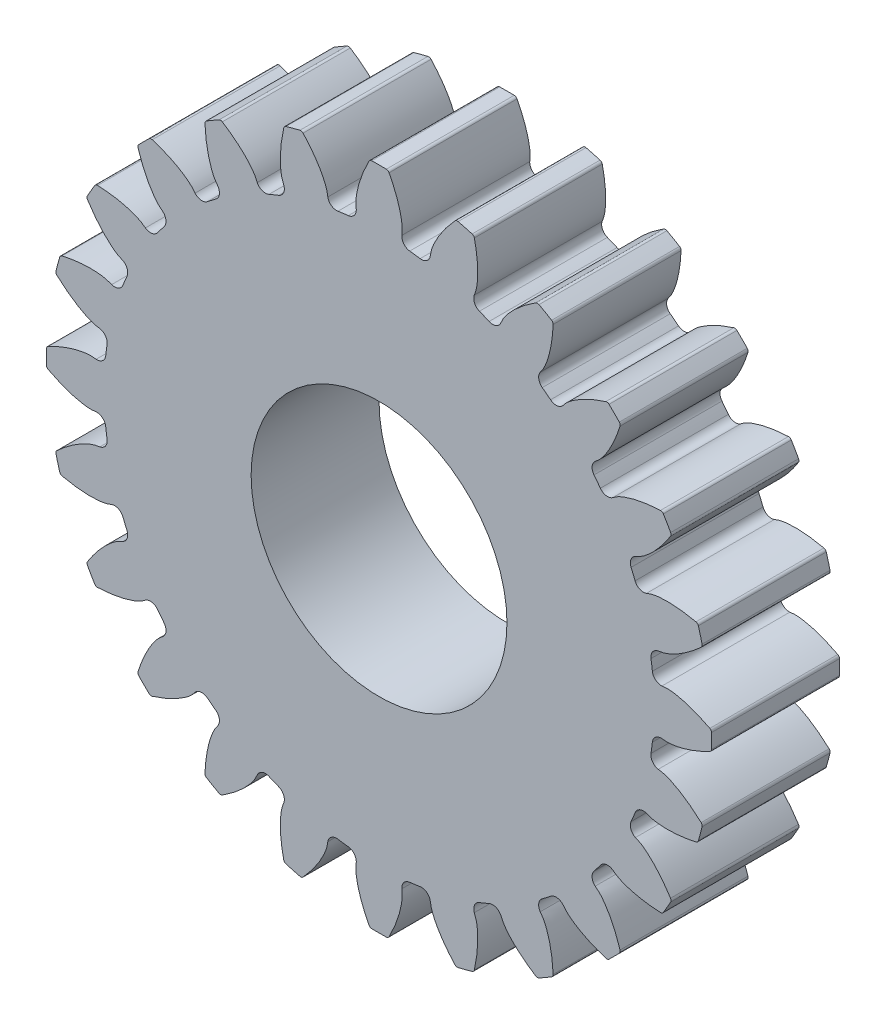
from build123d import *

# Parameters (mm, degrees)
FIRST_TOOTH_DEPTH      = 5
SKETCH3_R              = 10.75
ROOT_CIRCLE_DEPTH      = 5
ROOT_FILLET_R          = 0.35
TIP_RADIUS_R           = 0.125
TEETH_COUNT            = 24
ROOT_FILLET_OF_TEETH_R = 0.35
TIP_RADIUS_OF_TEETH_R  = 0.125
CENTER_HOLE_REACH      = 21.053
SKETCH4_R              = 5


with BuildPart() as part:
    # Sketch2 → First Tooth (new body)
    with BuildSketch(Plane.XY):
        with BuildLine():
            ThreePointArc((0.357729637, 12.995077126), (0, 13), (-0.357729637, 12.995077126))
            add(Edge.make_bspline(
                [(-0.357729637, 12.995077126), (-0.399563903, 12.91726348), (-0.459933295, 12.799256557), (-0.535150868, 12.639358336), (-0.588779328, 12.518162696), (-0.63945699, 12.395702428), (-0.686992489, 12.271986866), (-0.731162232, 12.14702795), (-0.771698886, 12.020840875), (-0.808276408, 11.893446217), (-0.840474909, 11.764869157), (-0.867757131, 11.635154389), (-0.889265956, 11.504332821), (-0.903946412, 11.372593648), (-0.908289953, 11.239772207), (-0.893638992, 11.107877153), (-0.884077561, 10.975733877), (-0.873152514, 10.843657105), (-0.8625924, 10.711562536), (-0.722121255, 8.970344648), (-0.590037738, 7.272920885), (-0.452562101, 5.619963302)],
                knots=[0, 0, 0, 0, 0.035369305, 0.053053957, 0.07073861, 0.088423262, 0.106107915, 0.123792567, 0.14147722, 0.159161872, 0.176846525, 0.194531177, 0.21221583, 0.229900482, 0.247585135, 0.265269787, 0.28295444, 0.300639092, 0.318323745, 0.336008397, 1, 1, 1, 1], degree=3))
            ThreePointArc((-0.452562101, 5.619963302), (0, -5.638155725), (0.452562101, 5.619963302))
            add(Edge.make_bspline(
                [(0.357729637, 12.995077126), (0.399563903, 12.91726348), (0.459933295, 12.799256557), (0.535150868, 12.639358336), (0.588779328, 12.518162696), (0.63945699, 12.395702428), (0.686992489, 12.271986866), (0.731162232, 12.14702795), (0.771698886, 12.020840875), (0.808276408, 11.893446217), (0.840474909, 11.764869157), (0.867757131, 11.635154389), (0.889265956, 11.504332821), (0.903946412, 11.372593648), (0.908289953, 11.239772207), (0.893638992, 11.107877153), (0.884077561, 10.975733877), (0.873152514, 10.843657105), (0.8625924, 10.711562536), (0.722121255, 8.970344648), (0.590037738, 7.272920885), (0.452562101, 5.619963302)],
                knots=[0, 0, 0, 0, 0.035369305, 0.053053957, 0.07073861, 0.088423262, 0.106107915, 0.123792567, 0.14147722, 0.159161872, 0.176846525, 0.194531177, 0.21221583, 0.229900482, 0.247585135, 0.265269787, 0.28295444, 0.300639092, 0.318323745, 0.336008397, 1, 1, 1, 1], degree=3))
        make_face()
    first_tooth = extrude(amount=FIRST_TOOTH_DEPTH)

    # Sketch3 → Root Circle (add)
    with BuildSketch(Plane.XY.offset(5)):
        Circle(SKETCH3_R)
    extrude(amount=-ROOT_CIRCLE_DEPTH)

    # Root Fillet
    root_fillet_edges = [part.edges().sort_by_distance(p)[0] for p in [
        (0.862877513, 10.715313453, 2.5),
        (-0.862877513, 10.715313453, 2.5),
    ]]
    fillet(root_fillet_edges, radius=ROOT_FILLET_R)

    # Tip Radius
    tip_radius_edges = [part.edges().sort_by_distance(p)[0] for p in [
        (-0.357729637, 12.995077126, 2.5),
        (0.357729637, 12.995077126, 2.5),
    ]]
    fillet(tip_radius_edges, radius=TIP_RADIUS_R)

    # Teeth: First Tooth ×24 about axis
    teeth_axis = Axis((0, 0, 5), (0, 0, -1))
    for i in range(1, TEETH_COUNT):
        add(first_tooth.rotate(teeth_axis, i * 360 / TEETH_COUNT))

    # Root Fillet of Teeth
    root_fillet_of_teeth_edges = [part.edges().sort_by_distance(p)[0] for p in [
        (3.60680287, 10.126868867, 2.5),
        (1.939851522, 10.573527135, 2.5),
        (6.104930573, 8.848294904, 2.5),
        (4.61038288, 9.711172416, 2.5),
        (8.187017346, 6.966724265, 2.5),
        (6.966724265, 8.187017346, 2.5),
        (9.711172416, 4.61038288, 2.5),
        (8.848294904, 6.104930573, 2.5),
        (10.573527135, 1.939851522, 2.5),
        (10.126868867, 3.60680287, 2.5),
        (10.715313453, -0.862877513, 2.5),
        (10.715313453, 0.862877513, 2.5),
        (10.126868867, -3.60680287, 2.5),
        (10.573527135, -1.939851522, 2.5),
        (8.848294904, -6.104930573, 2.5),
        (9.711172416, -4.61038288, 2.5),
        (6.966724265, -8.187017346, 2.5),
        (8.187017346, -6.966724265, 2.5),
        (4.61038288, -9.711172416, 2.5),
        (6.104930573, -8.848294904, 2.5),
        (1.939851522, -10.573527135, 2.5),
        (3.60680287, -10.126868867, 2.5),
        (-0.862877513, -10.715313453, 2.5),
        (0.862877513, -10.715313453, 2.5),
        (-3.60680287, -10.126868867, 2.5),
        (-1.939851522, -10.573527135, 2.5),
        (-6.104930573, -8.848294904, 2.5),
        (-4.61038288, -9.711172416, 2.5),
        (-8.187017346, -6.966724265, 2.5),
        (-6.966724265, -8.187017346, 2.5),
        (-9.711172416, -4.61038288, 2.5),
        (-8.848294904, -6.104930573, 2.5),
        (-10.573527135, -1.939851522, 2.5),
        (-10.126868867, -3.60680287, 2.5),
        (-10.715313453, 0.862877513, 2.5),
        (-10.715313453, -0.862877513, 2.5),
        (-10.126868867, 3.60680287, 2.5),
        (-10.573527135, 1.939851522, 2.5),
        (-8.848294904, 6.104930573, 2.5),
        (-9.711172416, 4.61038288, 2.5),
        (-6.966724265, 8.187017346, 2.5),
        (-8.187017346, 6.966724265, 2.5),
        (-4.61038288, 9.711172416, 2.5),
        (-6.104930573, 8.848294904, 2.5),
        (-1.939851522, 10.573527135, 2.5),
        (-3.60680287, 10.126868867, 2.5),
    ]]
    fillet(root_fillet_of_teeth_edges, radius=ROOT_FILLET_OF_TEETH_R)

    # Tip Radius of Teeth
    tip_radius_of_teeth_edges = [part.edges().sort_by_distance(p)[0] for p in [
        (3.017833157, 12.644867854, 2.5),
        (3.708913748, 12.459693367, 2.5),
        (6.187735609, 11.432931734, 2.5),
        (6.807341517, 11.075202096, 2.5),
        (8.935954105, 9.44186021, 2.5),
        (9.44186021, 8.935954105, 2.5),
        (11.075202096, 6.807341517, 2.5),
        (11.432931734, 6.187735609, 2.5),
        (12.459693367, 3.708913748, 2.5),
        (12.644867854, 3.017833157, 2.5),
        (12.995077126, 0.357729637, 2.5),
        (12.995077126, -0.357729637, 2.5),
        (12.644867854, -3.017833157, 2.5),
        (12.459693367, -3.708913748, 2.5),
        (11.432931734, -6.187735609, 2.5),
        (11.075202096, -6.807341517, 2.5),
        (9.44186021, -8.935954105, 2.5),
        (8.935954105, -9.44186021, 2.5),
        (6.807341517, -11.075202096, 2.5),
        (6.187735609, -11.432931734, 2.5),
        (3.708913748, -12.459693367, 2.5),
        (3.017833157, -12.644867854, 2.5),
        (0.357729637, -12.995077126, 2.5),
        (-0.357729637, -12.995077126, 2.5),
        (-3.017833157, -12.644867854, 2.5),
        (-3.708913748, -12.459693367, 2.5),
        (-6.187735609, -11.432931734, 2.5),
        (-6.807341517, -11.075202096, 2.5),
        (-8.935954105, -9.44186021, 2.5),
        (-9.44186021, -8.935954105, 2.5),
        (-11.075202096, -6.807341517, 2.5),
        (-11.432931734, -6.187735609, 2.5),
        (-12.459693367, -3.708913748, 2.5),
        (-12.644867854, -3.017833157, 2.5),
        (-12.995077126, -0.357729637, 2.5),
        (-12.995077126, 0.357729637, 2.5),
        (-12.644867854, 3.017833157, 2.5),
        (-12.459693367, 3.708913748, 2.5),
        (-11.432931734, 6.187735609, 2.5),
        (-11.075202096, 6.807341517, 2.5),
        (-9.44186021, 8.935954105, 2.5),
        (-8.935954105, 9.44186021, 2.5),
        (-6.807341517, 11.075202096, 2.5),
        (-6.187735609, 11.432931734, 2.5),
        (-3.708913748, 12.459693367, 2.5),
        (-3.017833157, 12.644867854, 2.5),
    ]]
    fillet(tip_radius_of_teeth_edges, radius=TIP_RADIUS_OF_TEETH_R)

    # Sketch4 → Center Hole (cut, up to next)
    with BuildSketch(Plane.XY.offset(5), mode=Mode.PRIVATE) as center_hole_sk1:
        Circle(SKETCH4_R)
    center_hole_tool1 = extrude(center_hole_sk1.sketch, amount=-CENTER_HOLE_REACH, mode=Mode.PRIVATE) & part.part
    add(center_hole_tool1.solids().sort_by_distance((0, 0, 5))[0], mode=Mode.SUBTRACT)


solid = part.part
